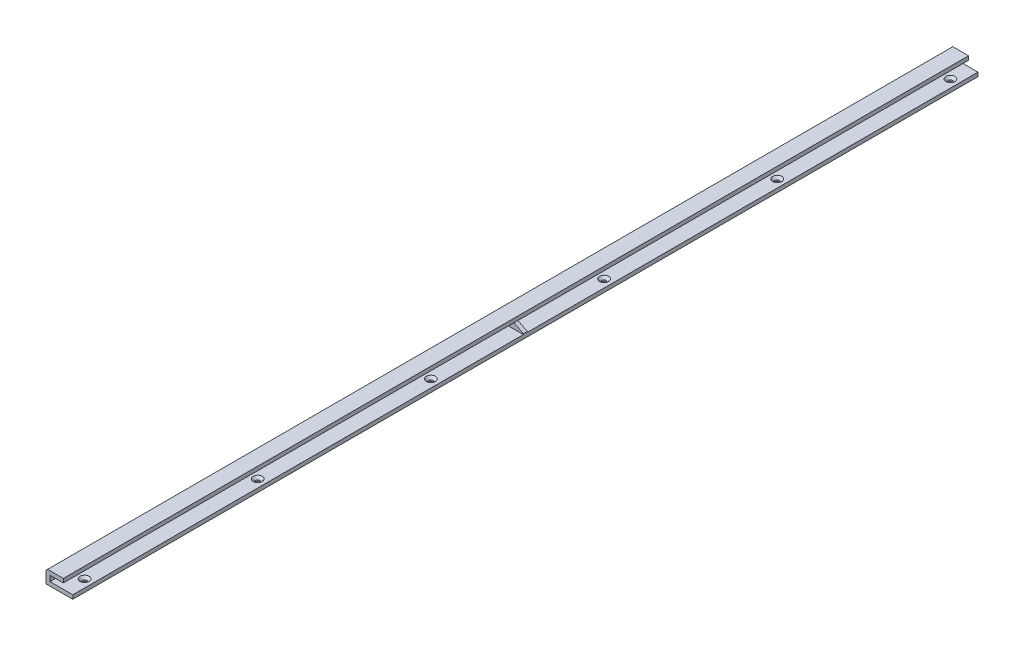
ISO-10303-21;
HEADER;
FILE_DESCRIPTION(('STEP AP214'),'2;1');
FILE_NAME('part.step','',(''),(''),'','','');
FILE_SCHEMA(('AUTOMOTIVE_DESIGN { 1 0 10303 214 1 1 1 1 }'));
ENDSEC;
DATA;
#1=APPLICATION_CONTEXT('core data for automotive mechanical design processes');
#2=APPLICATION_PROTOCOL_DEFINITION('international standard','automotive_design',2000,#1);
#3=PRODUCT_CONTEXT('',#1,'mechanical');
#4=PRODUCT('Part','Part','',(#3));
#5=PRODUCT_RELATED_PRODUCT_CATEGORY('part','',(#4));
#6=PRODUCT_DEFINITION_FORMATION('','',#4);
#7=PRODUCT_DEFINITION_CONTEXT('part definition',#1,'design');
#8=PRODUCT_DEFINITION('design','',#6,#7);
#9=PRODUCT_DEFINITION_SHAPE('','',#8);
#10=(LENGTH_UNIT() NAMED_UNIT(*) SI_UNIT(.MILLI.,.METRE.));
#11=(NAMED_UNIT(*) PLANE_ANGLE_UNIT() SI_UNIT($,.RADIAN.));
#12=(NAMED_UNIT(*) SI_UNIT($,.STERADIAN.) SOLID_ANGLE_UNIT());
#13=UNCERTAINTY_MEASURE_WITH_UNIT(LENGTH_MEASURE(1.E-05),#10,'distance_accuracy_value','');
#14=(GEOMETRIC_REPRESENTATION_CONTEXT(3) GLOBAL_UNCERTAINTY_ASSIGNED_CONTEXT((#13)) GLOBAL_UNIT_ASSIGNED_CONTEXT((#10,
#11,#12)) REPRESENTATION_CONTEXT('',''));
#15=CARTESIAN_POINT('',(0.,0.,0.));
#16=DIRECTION('',(0.,0.,1.));
#17=DIRECTION('',(1.,0.,0.));
#18=AXIS2_PLACEMENT_3D('',#15,#16,#17);
#19=CARTESIAN_POINT('',(0.,5.,-1150.));
#20=DIRECTION('',(0.,-1.,0.));
#21=DIRECTION('',(0.,0.,-1.));
#22=AXIS2_PLACEMENT_3D('',#19,#20,#21);
#23=PLANE('',#22);
#24=CARTESIAN_POINT('',(9.99999999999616,5.,-1125.));
#25=DIRECTION('',(0.,-1.,0.));
#26=DIRECTION('',(0.,0.,-1.));
#27=AXIS2_PLACEMENT_3D('',#24,#25,#26);
#28=CIRCLE('',#27,5.74999999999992);
#29=CARTESIAN_POINT('',(9.99999999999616,5.,-1130.75));
#30=VERTEX_POINT('',#29);
#31=EDGE_CURVE('E221',#30,#30,#28,.T.);
#32=ORIENTED_EDGE('',*,*,#31,.T.);
#33=EDGE_LOOP('',(#32));
#34=FACE_BOUND('',#33,.T.);
#35=CARTESIAN_POINT('',(9.99999999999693,5.,-905.));
#36=DIRECTION('',(0.,-1.,0.));
#37=DIRECTION('',(0.,0.,-1.));
#38=AXIS2_PLACEMENT_3D('',#35,#36,#37);
#39=CIRCLE('',#38,5.75000000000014);
#40=CARTESIAN_POINT('',(9.99999999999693,5.,-910.75));
#41=VERTEX_POINT('',#40);
#42=EDGE_CURVE('E218',#41,#41,#39,.T.);
#43=ORIENTED_EDGE('',*,*,#42,.T.);
#44=EDGE_LOOP('',(#43));
#45=FACE_BOUND('',#44,.T.);
#46=CARTESIAN_POINT('',(9.9999999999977,5.,-685.));
#47=DIRECTION('',(0.,-1.,0.));
#48=DIRECTION('',(0.,0.,-1.));
#49=AXIS2_PLACEMENT_3D('',#46,#47,#48);
#50=CIRCLE('',#49,5.75000000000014);
#51=CARTESIAN_POINT('',(9.9999999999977,5.,-690.75));
#52=VERTEX_POINT('',#51);
#53=EDGE_CURVE('E215',#52,#52,#50,.T.);
#54=ORIENTED_EDGE('',*,*,#53,.T.);
#55=EDGE_LOOP('',(#54));
#56=FACE_BOUND('',#55,.T.);
#57=DIRECTION('',(-1.,0.,0.));
#58=VECTOR('',#57,1.);
#59=CARTESIAN_POINT('',(20.,5.,-577.5));
#60=LINE('',#59,#58);
#61=CARTESIAN_POINT('',(20.,5.,-577.5));
#62=VERTEX_POINT('',#61);
#63=CARTESIAN_POINT('',(-9.,5.,-577.5));
#64=VERTEX_POINT('',#63);
#65=EDGE_CURVE('E138',#62,#64,#60,.T.);
#66=ORIENTED_EDGE('',*,*,#65,.F.);
#67=DIRECTION('',(0.,0.,-1.));
#68=VECTOR('',#67,1.);
#69=CARTESIAN_POINT('',(20.,5.,0.));
#70=LINE('',#69,#68);
#71=CARTESIAN_POINT('',(20.,5.,-1150.));
#72=VERTEX_POINT('',#71);
#73=EDGE_CURVE('E191',#62,#72,#70,.T.);
#74=ORIENTED_EDGE('',*,*,#73,.T.);
#75=DIRECTION('',(-1.,0.,0.));
#76=VECTOR('',#75,1.);
#77=CARTESIAN_POINT('',(0.,5.,-1150.));
#78=LINE('',#77,#76);
#79=CARTESIAN_POINT('',(-9.,5.,-1150.));
#80=VERTEX_POINT('',#79);
#81=EDGE_CURVE('E196',#72,#80,#78,.T.);
#82=ORIENTED_EDGE('',*,*,#81,.T.);
#83=DIRECTION('',(0.,0.,1.));
#84=VECTOR('',#83,1.);
#85=CARTESIAN_POINT('',(-9.,5.,-1150.));
#86=LINE('',#85,#84);
#87=EDGE_CURVE('E164',#80,#64,#86,.T.);
#88=ORIENTED_EDGE('',*,*,#87,.T.);
#89=EDGE_LOOP('',(#66,#74,#82,#88));
#90=FACE_BOUND('',#89,.T.);
#91=ADVANCED_FACE('F33',(#34,#45,#56,#90),#23,.F.);
#92=CARTESIAN_POINT('',(9.99999999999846,5.,-465.));
#93=DIRECTION('',(0.,-1.,0.));
#94=DIRECTION('',(0.,0.,-1.));
#95=AXIS2_PLACEMENT_3D('',#92,#93,#94);
#96=CIRCLE('',#95,5.74999999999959);
#97=CARTESIAN_POINT('',(9.99999999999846,5.,-470.75));
#98=VERTEX_POINT('',#97);
#99=EDGE_CURVE('E239',#98,#98,#96,.T.);
#100=ORIENTED_EDGE('',*,*,#99,.T.);
#101=EDGE_LOOP('',(#100));
#102=FACE_BOUND('',#101,.T.);
#103=CARTESIAN_POINT('',(9.99999999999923,5.,-245.));
#104=DIRECTION('',(0.,-1.,0.));
#105=DIRECTION('',(0.,0.,-1.));
#106=AXIS2_PLACEMENT_3D('',#103,#104,#105);
#107=CIRCLE('',#106,5.74999999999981);
#108=CARTESIAN_POINT('',(9.99999999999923,5.,-239.25));
#109=VERTEX_POINT('',#108);
#110=EDGE_CURVE('E236',#109,#109,#107,.T.);
#111=ORIENTED_EDGE('',*,*,#110,.T.);
#112=EDGE_LOOP('',(#111));
#113=FACE_BOUND('',#112,.T.);
#114=CARTESIAN_POINT('',(10.,5.,-25.));
#115=DIRECTION('',(0.,-1.,0.));
#116=DIRECTION('',(0.,0.,-1.));
#117=AXIS2_PLACEMENT_3D('',#114,#115,#116);
#118=CIRCLE('',#117,5.74999999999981);
#119=CARTESIAN_POINT('',(10.,5.,-30.7499999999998));
#120=VERTEX_POINT('',#119);
#121=EDGE_CURVE('E233',#120,#120,#118,.T.);
#122=ORIENTED_EDGE('',*,*,#121,.T.);
#123=EDGE_LOOP('',(#122));
#124=FACE_BOUND('',#123,.T.);
#125=DIRECTION('',(1.,0.,0.));
#126=VECTOR('',#125,1.);
#127=CARTESIAN_POINT('',(20.,5.,-572.5));
#128=LINE('',#127,#126);
#129=CARTESIAN_POINT('',(-9.,5.,-572.5));
#130=VERTEX_POINT('',#129);
#131=CARTESIAN_POINT('',(20.,5.,-572.5));
#132=VERTEX_POINT('',#131);
#133=EDGE_CURVE('E154',#130,#132,#128,.T.);
#134=ORIENTED_EDGE('',*,*,#133,.F.);
#135=CARTESIAN_POINT('',(-9.,5.,0.));
#136=VERTEX_POINT('',#135);
#137=EDGE_CURVE('E168',#130,#136,#86,.T.);
#138=ORIENTED_EDGE('',*,*,#137,.T.);
#139=DIRECTION('',(1.,0.,0.));
#140=VECTOR('',#139,1.);
#141=CARTESIAN_POINT('',(0.,5.,0.));
#142=LINE('',#141,#140);
#143=CARTESIAN_POINT('',(20.,5.,0.));
#144=VERTEX_POINT('',#143);
#145=EDGE_CURVE('E189',#136,#144,#142,.T.);
#146=ORIENTED_EDGE('',*,*,#145,.T.);
#147=EDGE_CURVE('E193',#144,#132,#70,.T.);
#148=ORIENTED_EDGE('',*,*,#147,.T.);
#149=EDGE_LOOP('',(#134,#138,#146,#148));
#150=FACE_BOUND('',#149,.T.);
#151=ADVANCED_FACE('F261',(#102,#113,#124,#150),#23,.F.);
#152=CARTESIAN_POINT('',(0.,12.,-1150.));
#153=DIRECTION('',(0.,-1.,0.));
#154=DIRECTION('',(0.,0.,-1.));
#155=AXIS2_PLACEMENT_3D('',#152,#153,#154);
#156=PLANE('',#155);
#157=DIRECTION('',(0.,0.,1.));
#158=VECTOR('',#157,1.);
#159=CARTESIAN_POINT('',(8.,12.,-1150.));
#160=LINE('',#159,#158);
#161=CARTESIAN_POINT('',(8.,12.,-1150.));
#162=VERTEX_POINT('',#161);
#163=CARTESIAN_POINT('',(8.,12.,-577.5));
#164=VERTEX_POINT('',#163);
#165=EDGE_CURVE('E152',#162,#164,#160,.T.);
#166=ORIENTED_EDGE('',*,*,#165,.T.);
#167=DIRECTION('',(-1.,0.,0.));
#168=VECTOR('',#167,1.);
#169=CARTESIAN_POINT('',(20.,12.,-577.5));
#170=LINE('',#169,#168);
#171=CARTESIAN_POINT('',(-9.,12.,-577.5));
#172=VERTEX_POINT('',#171);
#173=EDGE_CURVE('E135',#164,#172,#170,.T.);
#174=ORIENTED_EDGE('',*,*,#173,.T.);
#175=DIRECTION('',(0.,0.,1.));
#176=VECTOR('',#175,1.);
#177=CARTESIAN_POINT('',(-9.,12.,-1150.));
#178=LINE('',#177,#176);
#179=CARTESIAN_POINT('',(-9.,12.,-1150.));
#180=VERTEX_POINT('',#179);
#181=EDGE_CURVE('E149',#180,#172,#178,.T.);
#182=ORIENTED_EDGE('',*,*,#181,.F.);
#183=DIRECTION('',(1.,0.,0.));
#184=VECTOR('',#183,1.);
#185=CARTESIAN_POINT('',(0.,12.,-1150.));
#186=LINE('',#185,#184);
#187=EDGE_CURVE('E372',#180,#162,#186,.T.);
#188=ORIENTED_EDGE('',*,*,#187,.T.);
#189=EDGE_LOOP('',(#166,#174,#182,#188));
#190=FACE_BOUND('',#189,.T.);
#191=ADVANCED_FACE('F148',(#190),#156,.T.);
#192=CARTESIAN_POINT('',(-9.,12.,-572.5));
#193=VERTEX_POINT('',#192);
#194=CARTESIAN_POINT('',(-9.,12.,0.));
#195=VERTEX_POINT('',#194);
#196=EDGE_CURVE('E161',#193,#195,#178,.T.);
#197=ORIENTED_EDGE('',*,*,#196,.F.);
#198=DIRECTION('',(1.,0.,0.));
#199=VECTOR('',#198,1.);
#200=CARTESIAN_POINT('',(20.,12.,-572.5));
#201=LINE('',#200,#199);
#202=CARTESIAN_POINT('',(8.,12.,-572.5));
#203=VERTEX_POINT('',#202);
#204=EDGE_CURVE('E153',#193,#203,#201,.T.);
#205=ORIENTED_EDGE('',*,*,#204,.T.);
#206=CARTESIAN_POINT('',(8.,12.,0.));
#207=VERTEX_POINT('',#206);
#208=EDGE_CURVE('E160',#203,#207,#160,.T.);
#209=ORIENTED_EDGE('',*,*,#208,.T.);
#210=DIRECTION('',(1.,0.,0.));
#211=VECTOR('',#210,1.);
#212=CARTESIAN_POINT('',(0.,12.,0.));
#213=LINE('',#212,#211);
#214=EDGE_CURVE('E396',#195,#207,#213,.T.);
#215=ORIENTED_EDGE('',*,*,#214,.F.);
#216=EDGE_LOOP('',(#197,#205,#209,#215));
#217=FACE_BOUND('',#216,.T.);
#218=ADVANCED_FACE('F422',(#217),#156,.T.);
#219=CARTESIAN_POINT('',(-9.,5.,-1150.));
#220=DIRECTION('',(1.,0.,0.));
#221=DIRECTION('',(0.,0.,-1.));
#222=AXIS2_PLACEMENT_3D('',#219,#220,#221);
#223=PLANE('',#222);
#224=ORIENTED_EDGE('',*,*,#181,.T.);
#225=DIRECTION('',(0.,-1.,0.));
#226=VECTOR('',#225,1.);
#227=CARTESIAN_POINT('',(-9.,12.,-577.5));
#228=LINE('',#227,#226);
#229=EDGE_CURVE('E132',#172,#64,#228,.T.);
#230=ORIENTED_EDGE('',*,*,#229,.T.);
#231=ORIENTED_EDGE('',*,*,#87,.F.);
#232=DIRECTION('',(0.,1.,0.));
#233=VECTOR('',#232,1.);
#234=CARTESIAN_POINT('',(-9.,5.,-1150.));
#235=LINE('',#234,#233);
#236=EDGE_CURVE('E159',#80,#180,#235,.T.);
#237=ORIENTED_EDGE('',*,*,#236,.T.);
#238=EDGE_LOOP('',(#224,#230,#231,#237));
#239=FACE_BOUND('',#238,.T.);
#240=ADVANCED_FACE('F157',(#239),#223,.T.);
#241=ORIENTED_EDGE('',*,*,#137,.F.);
#242=DIRECTION('',(0.,-1.,0.));
#243=VECTOR('',#242,1.);
#244=CARTESIAN_POINT('',(-9.,12.,-572.5));
#245=LINE('',#244,#243);
#246=EDGE_CURVE('E144',#193,#130,#245,.T.);
#247=ORIENTED_EDGE('',*,*,#246,.F.);
#248=ORIENTED_EDGE('',*,*,#196,.T.);
#249=DIRECTION('',(0.,1.,0.));
#250=VECTOR('',#249,1.);
#251=CARTESIAN_POINT('',(-9.,5.,0.));
#252=LINE('',#251,#250);
#253=EDGE_CURVE('E398',#136,#195,#252,.T.);
#254=ORIENTED_EDGE('',*,*,#253,.F.);
#255=EDGE_LOOP('',(#241,#247,#248,#254));
#256=FACE_BOUND('',#255,.T.);
#257=ADVANCED_FACE('F277',(#256),#223,.T.);
#258=CARTESIAN_POINT('',(0.,0.,-1150.));
#259=DIRECTION('',(0.,-1.,0.));
#260=DIRECTION('',(0.,0.,-1.));
#261=AXIS2_PLACEMENT_3D('',#258,#259,#260);
#262=PLANE('',#261);
#263=CARTESIAN_POINT('',(9.99999999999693,0.,-905.));
#264=DIRECTION('',(0.,1.,0.));
#265=DIRECTION('',(0.,0.,1.));
#266=AXIS2_PLACEMENT_3D('',#263,#264,#265);
#267=CIRCLE('',#266,2.74999999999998);
#268=CARTESIAN_POINT('',(9.99999999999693,0.,-902.25));
#269=VERTEX_POINT('',#268);
#270=EDGE_CURVE('E172',#269,#269,#267,.T.);
#271=ORIENTED_EDGE('',*,*,#270,.T.);
#272=EDGE_LOOP('',(#271));
#273=FACE_BOUND('',#272,.T.);
#274=CARTESIAN_POINT('',(9.99999999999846,0.,-465.));
#275=DIRECTION('',(0.,1.,0.));
#276=DIRECTION('',(0.,0.,1.));
#277=AXIS2_PLACEMENT_3D('',#274,#275,#276);
#278=CIRCLE('',#277,2.75);
#279=CARTESIAN_POINT('',(9.99999999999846,0.,-462.25));
#280=VERTEX_POINT('',#279);
#281=EDGE_CURVE('E179',#280,#280,#278,.T.);
#282=ORIENTED_EDGE('',*,*,#281,.T.);
#283=EDGE_LOOP('',(#282));
#284=FACE_BOUND('',#283,.T.);
#285=CARTESIAN_POINT('',(10.,0.,-25.));
#286=DIRECTION('',(0.,1.,0.));
#287=DIRECTION('',(0.,0.,1.));
#288=AXIS2_PLACEMENT_3D('',#285,#286,#287);
#289=CIRCLE('',#288,2.75);
#290=CARTESIAN_POINT('',(10.,0.,-22.25));
#291=VERTEX_POINT('',#290);
#292=EDGE_CURVE('E185',#291,#291,#289,.T.);
#293=ORIENTED_EDGE('',*,*,#292,.T.);
#294=EDGE_LOOP('',(#293));
#295=FACE_BOUND('',#294,.T.);
#296=DIRECTION('',(1.,0.,0.));
#297=VECTOR('',#296,1.);
#298=CARTESIAN_POINT('',(0.,0.,0.));
#299=LINE('',#298,#297);
#300=CARTESIAN_POINT('',(-14.,0.,0.));
#301=VERTEX_POINT('',#300);
#302=CARTESIAN_POINT('',(20.,0.,0.));
#303=VERTEX_POINT('',#302);
#304=EDGE_CURVE('E188',#301,#303,#299,.T.);
#305=ORIENTED_EDGE('',*,*,#304,.F.);
#306=DIRECTION('',(0.,0.,1.));
#307=VECTOR('',#306,1.);
#308=CARTESIAN_POINT('',(-14.,0.,-1150.));
#309=LINE('',#308,#307);
#310=CARTESIAN_POINT('',(-14.,0.,-1150.));
#311=VERTEX_POINT('',#310);
#312=EDGE_CURVE('E173',#311,#301,#309,.T.);
#313=ORIENTED_EDGE('',*,*,#312,.F.);
#314=DIRECTION('',(-1.,0.,0.));
#315=VECTOR('',#314,1.);
#316=CARTESIAN_POINT('',(0.,0.,-1150.));
#317=LINE('',#316,#315);
#318=CARTESIAN_POINT('',(20.,0.,-1150.));
#319=VERTEX_POINT('',#318);
#320=EDGE_CURVE('E192',#319,#311,#317,.T.);
#321=ORIENTED_EDGE('',*,*,#320,.F.);
#322=DIRECTION('',(0.,0.,-1.));
#323=VECTOR('',#322,1.);
#324=CARTESIAN_POINT('',(20.,0.,0.));
#325=LINE('',#324,#323);
#326=EDGE_CURVE('E200',#303,#319,#325,.T.);
#327=ORIENTED_EDGE('',*,*,#326,.F.);
#328=EDGE_LOOP('',(#305,#313,#321,#327));
#329=FACE_BOUND('',#328,.T.);
#330=CARTESIAN_POINT('',(9.99999999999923,0.,-245.));
#331=DIRECTION('',(0.,1.,0.));
#332=DIRECTION('',(0.,0.,1.));
#333=AXIS2_PLACEMENT_3D('',#330,#331,#332);
#334=CIRCLE('',#333,2.75);
#335=CARTESIAN_POINT('',(9.99999999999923,0.,-242.25));
#336=VERTEX_POINT('',#335);
#337=EDGE_CURVE('E182',#336,#336,#334,.T.);
#338=ORIENTED_EDGE('',*,*,#337,.T.);
#339=EDGE_LOOP('',(#338));
#340=FACE_BOUND('',#339,.T.);
#341=CARTESIAN_POINT('',(9.9999999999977,0.,-685.));
#342=DIRECTION('',(0.,1.,0.));
#343=DIRECTION('',(0.,0.,1.));
#344=AXIS2_PLACEMENT_3D('',#341,#342,#343);
#345=CIRCLE('',#344,2.74999999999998);
#346=CARTESIAN_POINT('',(9.9999999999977,0.,-682.25));
#347=VERTEX_POINT('',#346);
#348=EDGE_CURVE('E176',#347,#347,#345,.T.);
#349=ORIENTED_EDGE('',*,*,#348,.T.);
#350=EDGE_LOOP('',(#349));
#351=FACE_BOUND('',#350,.T.);
#352=CARTESIAN_POINT('',(9.99999999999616,0.,-1125.));
#353=DIRECTION('',(0.,1.,0.));
#354=DIRECTION('',(0.,0.,1.));
#355=AXIS2_PLACEMENT_3D('',#352,#353,#354);
#356=CIRCLE('',#355,2.74999999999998);
#357=CARTESIAN_POINT('',(9.99999999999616,0.,-1122.25));
#358=VERTEX_POINT('',#357);
#359=EDGE_CURVE('E169',#358,#358,#356,.T.);
#360=ORIENTED_EDGE('',*,*,#359,.T.);
#361=EDGE_LOOP('',(#360));
#362=FACE_BOUND('',#361,.T.);
#363=ADVANCED_FACE('F273',(#273,#284,#295,#329,#340,#351,#362),#262,.T.);
#364=CARTESIAN_POINT('',(0.,5.,0.));
#365=DIRECTION('',(0.,0.,-1.));
#366=DIRECTION('',(-1.,0.,0.));
#367=AXIS2_PLACEMENT_3D('',#364,#365,#366);
#368=PLANE('',#367);
#369=ORIENTED_EDGE('',*,*,#304,.T.);
#370=DIRECTION('',(0.,-1.,0.));
#371=VECTOR('',#370,1.);
#372=CARTESIAN_POINT('',(20.,5.,0.));
#373=LINE('',#372,#371);
#374=EDGE_CURVE('E205',#144,#303,#373,.T.);
#375=ORIENTED_EDGE('',*,*,#374,.F.);
#376=ORIENTED_EDGE('',*,*,#145,.F.);
#377=ORIENTED_EDGE('',*,*,#253,.T.);
#378=ORIENTED_EDGE('',*,*,#214,.T.);
#379=DIRECTION('',(0.,1.,0.));
#380=VECTOR('',#379,1.);
#381=CARTESIAN_POINT('',(8.,17.,0.));
#382=LINE('',#381,#380);
#383=CARTESIAN_POINT('',(8.,17.,0.));
#384=VERTEX_POINT('',#383);
#385=EDGE_CURVE('E388',#207,#384,#382,.T.);
#386=ORIENTED_EDGE('',*,*,#385,.T.);
#387=DIRECTION('',(-1.,0.,0.));
#388=VECTOR('',#387,1.);
#389=CARTESIAN_POINT('',(0.,17.,0.));
#390=LINE('',#389,#388);
#391=CARTESIAN_POINT('',(-12.,17.,0.));
#392=VERTEX_POINT('',#391);
#393=EDGE_CURVE('E374',#384,#392,#390,.T.);
#394=ORIENTED_EDGE('',*,*,#393,.T.);
#395=DIRECTION('',(-0.707106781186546,-0.707106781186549,0.));
#396=VECTOR('',#395,1.);
#397=CARTESIAN_POINT('',(-14.,15.,0.));
#398=LINE('',#397,#396);
#399=CARTESIAN_POINT('',(-14.,15.,0.));
#400=VERTEX_POINT('',#399);
#401=EDGE_CURVE('E370',#392,#400,#398,.T.);
#402=ORIENTED_EDGE('',*,*,#401,.T.);
#403=DIRECTION('',(0.,-1.,0.));
#404=VECTOR('',#403,1.);
#405=CARTESIAN_POINT('',(-14.,0.,0.));
#406=LINE('',#405,#404);
#407=EDGE_CURVE('E362',#400,#301,#406,.T.);
#408=ORIENTED_EDGE('',*,*,#407,.T.);
#409=EDGE_LOOP('',(#369,#375,#376,#377,#378,#386,#394,#402,#408));
#410=FACE_BOUND('',#409,.T.);
#411=ADVANCED_FACE('F276',(#410),#368,.F.);
#412=CARTESIAN_POINT('',(20.,5.,0.));
#413=DIRECTION('',(-1.,0.,0.));
#414=DIRECTION('',(0.,0.,1.));
#415=AXIS2_PLACEMENT_3D('',#412,#413,#414);
#416=PLANE('',#415);
#417=DIRECTION('',(0.,-1.,0.));
#418=VECTOR('',#417,1.);
#419=CARTESIAN_POINT('',(20.,12.,-577.5));
#420=LINE('',#419,#418);
#421=CARTESIAN_POINT('',(20.,5.99999999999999,-577.5));
#422=VERTEX_POINT('',#421);
#423=EDGE_CURVE('E143',#422,#62,#420,.T.);
#424=ORIENTED_EDGE('',*,*,#423,.F.);
#425=DIRECTION('',(0.,0.,1.));
#426=VECTOR('',#425,1.);
#427=CARTESIAN_POINT('',(20.,5.99999999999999,0.));
#428=LINE('',#427,#426);
#429=CARTESIAN_POINT('',(20.,5.99999999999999,-572.5));
#430=VERTEX_POINT('',#429);
#431=EDGE_CURVE('E48',#422,#430,#428,.T.);
#432=ORIENTED_EDGE('',*,*,#431,.T.);
#433=DIRECTION('',(0.,-1.,0.));
#434=VECTOR('',#433,1.);
#435=CARTESIAN_POINT('',(20.,12.,-572.5));
#436=LINE('',#435,#434);
#437=EDGE_CURVE('E414',#430,#132,#436,.T.);
#438=ORIENTED_EDGE('',*,*,#437,.T.);
#439=ORIENTED_EDGE('',*,*,#147,.F.);
#440=ORIENTED_EDGE('',*,*,#374,.T.);
#441=ORIENTED_EDGE('',*,*,#326,.T.);
#442=DIRECTION('',(0.,-1.,0.));
#443=VECTOR('',#442,1.);
#444=CARTESIAN_POINT('',(20.,5.,-1150.));
#445=LINE('',#444,#443);
#446=EDGE_CURVE('E198',#72,#319,#445,.T.);
#447=ORIENTED_EDGE('',*,*,#446,.F.);
#448=ORIENTED_EDGE('',*,*,#73,.F.);
#449=EDGE_LOOP('',(#424,#432,#438,#439,#440,#441,#447,#448));
#450=FACE_BOUND('',#449,.T.);
#451=ADVANCED_FACE('F282',(#450),#416,.F.);
#452=CARTESIAN_POINT('',(0.,5.,-1150.));
#453=DIRECTION('',(0.,0.,1.));
#454=DIRECTION('',(1.,0.,0.));
#455=AXIS2_PLACEMENT_3D('',#452,#453,#454);
#456=PLANE('',#455);
#457=ORIENTED_EDGE('',*,*,#320,.T.);
#458=DIRECTION('',(0.,-1.,0.));
#459=VECTOR('',#458,1.);
#460=CARTESIAN_POINT('',(-14.,0.,-1150.));
#461=LINE('',#460,#459);
#462=CARTESIAN_POINT('',(-14.,15.,-1150.));
#463=VERTEX_POINT('',#462);
#464=EDGE_CURVE('E365',#463,#311,#461,.T.);
#465=ORIENTED_EDGE('',*,*,#464,.F.);
#466=DIRECTION('',(-0.707106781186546,-0.707106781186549,0.));
#467=VECTOR('',#466,1.);
#468=CARTESIAN_POINT('',(-14.,15.,-1150.));
#469=LINE('',#468,#467);
#470=CARTESIAN_POINT('',(-12.,17.,-1150.));
#471=VERTEX_POINT('',#470);
#472=EDGE_CURVE('E404',#471,#463,#469,.T.);
#473=ORIENTED_EDGE('',*,*,#472,.F.);
#474=DIRECTION('',(-1.,0.,0.));
#475=VECTOR('',#474,1.);
#476=CARTESIAN_POINT('',(0.,17.,-1150.));
#477=LINE('',#476,#475);
#478=CARTESIAN_POINT('',(8.,17.,-1150.));
#479=VERTEX_POINT('',#478);
#480=EDGE_CURVE('E407',#479,#471,#477,.T.);
#481=ORIENTED_EDGE('',*,*,#480,.F.);
#482=DIRECTION('',(0.,1.,0.));
#483=VECTOR('',#482,1.);
#484=CARTESIAN_POINT('',(8.,17.,-1150.));
#485=LINE('',#484,#483);
#486=EDGE_CURVE('E391',#162,#479,#485,.T.);
#487=ORIENTED_EDGE('',*,*,#486,.F.);
#488=ORIENTED_EDGE('',*,*,#187,.F.);
#489=ORIENTED_EDGE('',*,*,#236,.F.);
#490=ORIENTED_EDGE('',*,*,#81,.F.);
#491=ORIENTED_EDGE('',*,*,#446,.T.);
#492=EDGE_LOOP('',(#457,#465,#473,#481,#487,#488,#489,#490,#491));
#493=FACE_BOUND('',#492,.T.);
#494=ADVANCED_FACE('F279',(#493),#456,.F.);
#495=CARTESIAN_POINT('',(10.,5.,-25.));
#496=DIRECTION('',(0.,-1.,0.));
#497=DIRECTION('',(0.,0.,-1.));
#498=AXIS2_PLACEMENT_3D('',#495,#496,#497);
#499=CYLINDRICAL_SURFACE('',#498,2.75);
#500=CARTESIAN_POINT('',(10.,2.00000000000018,-25.));
#501=DIRECTION('',(0.,-1.,0.));
#502=DIRECTION('',(0.,0.,-1.));
#503=AXIS2_PLACEMENT_3D('',#500,#501,#502);
#504=CIRCLE('',#503,2.75);
#505=CARTESIAN_POINT('',(10.,2.00000000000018,-27.75));
#506=VERTEX_POINT('',#505);
#507=EDGE_CURVE('E11',#506,#506,#504,.F.);
#508=ORIENTED_EDGE('',*,*,#507,.T.);
#509=EDGE_LOOP('',(#508));
#510=FACE_BOUND('',#509,.T.);
#511=ORIENTED_EDGE('',*,*,#292,.F.);
#512=EDGE_LOOP('',(#511));
#513=FACE_BOUND('',#512,.T.);
#514=ADVANCED_FACE('F271',(#510,#513),#499,.F.);
#515=CARTESIAN_POINT('',(9.99999999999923,5.,-245.));
#516=DIRECTION('',(0.,-1.,0.));
#517=DIRECTION('',(0.,0.,-1.));
#518=AXIS2_PLACEMENT_3D('',#515,#516,#517);
#519=CYLINDRICAL_SURFACE('',#518,2.75);
#520=CARTESIAN_POINT('',(9.99999999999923,2.00000000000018,-245.));
#521=DIRECTION('',(0.,-1.,0.));
#522=DIRECTION('',(0.,0.,-1.));
#523=AXIS2_PLACEMENT_3D('',#520,#521,#522);
#524=CIRCLE('',#523,2.75);
#525=CARTESIAN_POINT('',(9.99999999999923,2.00000000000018,-242.25));
#526=VERTEX_POINT('',#525);
#527=EDGE_CURVE('E41',#526,#526,#524,.F.);
#528=ORIENTED_EDGE('',*,*,#527,.T.);
#529=EDGE_LOOP('',(#528));
#530=FACE_BOUND('',#529,.T.);
#531=ORIENTED_EDGE('',*,*,#337,.F.);
#532=EDGE_LOOP('',(#531));
#533=FACE_BOUND('',#532,.T.);
#534=ADVANCED_FACE('F244',(#530,#533),#519,.F.);
#535=CARTESIAN_POINT('',(9.99999999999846,5.,-465.));
#536=DIRECTION('',(0.,-1.,0.));
#537=DIRECTION('',(0.,0.,-1.));
#538=AXIS2_PLACEMENT_3D('',#535,#536,#537);
#539=CYLINDRICAL_SURFACE('',#538,2.75);
#540=CARTESIAN_POINT('',(9.99999999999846,2.00000000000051,-465.));
#541=DIRECTION('',(0.,-1.,0.));
#542=DIRECTION('',(0.,0.,-1.));
#543=AXIS2_PLACEMENT_3D('',#540,#541,#542);
#544=CIRCLE('',#543,2.75);
#545=CARTESIAN_POINT('',(9.99999999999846,2.00000000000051,-467.75));
#546=VERTEX_POINT('',#545);
#547=EDGE_CURVE('E230',#546,#546,#544,.F.);
#548=ORIENTED_EDGE('',*,*,#547,.T.);
#549=EDGE_LOOP('',(#548));
#550=FACE_BOUND('',#549,.T.);
#551=ORIENTED_EDGE('',*,*,#281,.F.);
#552=EDGE_LOOP('',(#551));
#553=FACE_BOUND('',#552,.T.);
#554=ADVANCED_FACE('F314',(#550,#553),#539,.F.);
#555=CARTESIAN_POINT('',(9.9999999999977,5.,-685.));
#556=DIRECTION('',(0.,-1.,0.));
#557=DIRECTION('',(0.,0.,-1.));
#558=AXIS2_PLACEMENT_3D('',#555,#556,#557);
#559=CYLINDRICAL_SURFACE('',#558,2.74999999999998);
#560=CARTESIAN_POINT('',(9.9999999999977,1.99999999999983,-685.));
#561=DIRECTION('',(0.,-1.,0.));
#562=DIRECTION('',(0.,0.,-1.));
#563=AXIS2_PLACEMENT_3D('',#560,#561,#562);
#564=CIRCLE('',#563,2.74999999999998);
#565=CARTESIAN_POINT('',(9.9999999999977,1.99999999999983,-687.75));
#566=VERTEX_POINT('',#565);
#567=EDGE_CURVE('E227',#566,#566,#564,.F.);
#568=ORIENTED_EDGE('',*,*,#567,.T.);
#569=EDGE_LOOP('',(#568));
#570=FACE_BOUND('',#569,.T.);
#571=ORIENTED_EDGE('',*,*,#348,.F.);
#572=EDGE_LOOP('',(#571));
#573=FACE_BOUND('',#572,.T.);
#574=ADVANCED_FACE('F310',(#570,#573),#559,.F.);
#575=CARTESIAN_POINT('',(9.99999999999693,5.,-905.));
#576=DIRECTION('',(0.,-1.,0.));
#577=DIRECTION('',(0.,0.,-1.));
#578=AXIS2_PLACEMENT_3D('',#575,#576,#577);
#579=CYLINDRICAL_SURFACE('',#578,2.74999999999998);
#580=CARTESIAN_POINT('',(9.99999999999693,1.99999999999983,-905.));
#581=DIRECTION('',(0.,-1.,0.));
#582=DIRECTION('',(0.,0.,-1.));
#583=AXIS2_PLACEMENT_3D('',#580,#581,#582);
#584=CIRCLE('',#583,2.74999999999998);
#585=CARTESIAN_POINT('',(9.99999999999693,1.99999999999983,-907.75));
#586=VERTEX_POINT('',#585);
#587=EDGE_CURVE('E224',#586,#586,#584,.F.);
#588=ORIENTED_EDGE('',*,*,#587,.T.);
#589=EDGE_LOOP('',(#588));
#590=FACE_BOUND('',#589,.T.);
#591=ORIENTED_EDGE('',*,*,#270,.F.);
#592=EDGE_LOOP('',(#591));
#593=FACE_BOUND('',#592,.T.);
#594=ADVANCED_FACE('F313',(#590,#593),#579,.F.);
#595=CARTESIAN_POINT('',(9.99999999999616,5.,-1125.));
#596=DIRECTION('',(0.,-1.,0.));
#597=DIRECTION('',(0.,0.,-1.));
#598=AXIS2_PLACEMENT_3D('',#595,#596,#597);
#599=CYLINDRICAL_SURFACE('',#598,2.74999999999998);
#600=CARTESIAN_POINT('',(9.99999999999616,1.99999999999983,-1125.));
#601=DIRECTION('',(0.,-1.,0.));
#602=DIRECTION('',(0.,0.,-1.));
#603=AXIS2_PLACEMENT_3D('',#600,#601,#602);
#604=CIRCLE('',#603,2.74999999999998);
#605=CARTESIAN_POINT('',(9.99999999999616,1.99999999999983,-1127.75));
#606=VERTEX_POINT('',#605);
#607=EDGE_CURVE('E212',#606,#606,#604,.F.);
#608=ORIENTED_EDGE('',*,*,#607,.T.);
#609=EDGE_LOOP('',(#608));
#610=FACE_BOUND('',#609,.T.);
#611=ORIENTED_EDGE('',*,*,#359,.F.);
#612=EDGE_LOOP('',(#611));
#613=FACE_BOUND('',#612,.T.);
#614=ADVANCED_FACE('F321',(#610,#613),#599,.F.);
#615=CARTESIAN_POINT('',(-14.,0.,-1150.));
#616=DIRECTION('',(-1.,0.,0.));
#617=DIRECTION('',(0.,0.,1.));
#618=AXIS2_PLACEMENT_3D('',#615,#616,#617);
#619=PLANE('',#618);
#620=ORIENTED_EDGE('',*,*,#407,.F.);
#621=DIRECTION('',(0.,0.,1.));
#622=VECTOR('',#621,1.);
#623=CARTESIAN_POINT('',(-14.,15.,-1150.));
#624=LINE('',#623,#622);
#625=EDGE_CURVE('E366',#463,#400,#624,.T.);
#626=ORIENTED_EDGE('',*,*,#625,.F.);
#627=ORIENTED_EDGE('',*,*,#464,.T.);
#628=ORIENTED_EDGE('',*,*,#312,.T.);
#629=EDGE_LOOP('',(#620,#626,#627,#628));
#630=FACE_BOUND('',#629,.T.);
#631=ADVANCED_FACE('F323',(#630),#619,.T.);
#632=CARTESIAN_POINT('',(-14.,15.,-1150.));
#633=DIRECTION('',(-0.707106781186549,0.707106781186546,0.));
#634=DIRECTION('',(-0.707106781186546,-0.707106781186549,0.));
#635=AXIS2_PLACEMENT_3D('',#632,#633,#634);
#636=PLANE('',#635);
#637=ORIENTED_EDGE('',*,*,#401,.F.);
#638=DIRECTION('',(0.,0.,1.));
#639=VECTOR('',#638,1.);
#640=CARTESIAN_POINT('',(-12.,17.,-1150.));
#641=LINE('',#640,#639);
#642=EDGE_CURVE('E379',#471,#392,#641,.T.);
#643=ORIENTED_EDGE('',*,*,#642,.F.);
#644=ORIENTED_EDGE('',*,*,#472,.T.);
#645=ORIENTED_EDGE('',*,*,#625,.T.);
#646=EDGE_LOOP('',(#637,#643,#644,#645));
#647=FACE_BOUND('',#646,.T.);
#648=ADVANCED_FACE('F330',(#647),#636,.T.);
#649=CARTESIAN_POINT('',(0.,17.,-1150.));
#650=DIRECTION('',(0.,1.,0.));
#651=DIRECTION('',(0.,0.,1.));
#652=AXIS2_PLACEMENT_3D('',#649,#650,#651);
#653=PLANE('',#652);
#654=ORIENTED_EDGE('',*,*,#393,.F.);
#655=DIRECTION('',(0.,0.,1.));
#656=VECTOR('',#655,1.);
#657=CARTESIAN_POINT('',(8.,17.,-1150.));
#658=LINE('',#657,#656);
#659=EDGE_CURVE('E380',#479,#384,#658,.T.);
#660=ORIENTED_EDGE('',*,*,#659,.F.);
#661=ORIENTED_EDGE('',*,*,#480,.T.);
#662=ORIENTED_EDGE('',*,*,#642,.T.);
#663=EDGE_LOOP('',(#654,#660,#661,#662));
#664=FACE_BOUND('',#663,.T.);
#665=ADVANCED_FACE('F447',(#664),#653,.T.);
#666=CARTESIAN_POINT('',(8.,17.,-1150.));
#667=DIRECTION('',(1.,0.,0.));
#668=DIRECTION('',(0.,0.,-1.));
#669=AXIS2_PLACEMENT_3D('',#666,#667,#668);
#670=PLANE('',#669);
#671=ORIENTED_EDGE('',*,*,#385,.F.);
#672=ORIENTED_EDGE('',*,*,#208,.F.);
#673=DIRECTION('',(0.,0.,-1.));
#674=VECTOR('',#673,1.);
#675=CARTESIAN_POINT('',(8.,12.,-1150.));
#676=LINE('',#675,#674);
#677=EDGE_CURVE('E402',#203,#164,#676,.T.);
#678=ORIENTED_EDGE('',*,*,#677,.T.);
#679=ORIENTED_EDGE('',*,*,#165,.F.);
#680=ORIENTED_EDGE('',*,*,#486,.T.);
#681=ORIENTED_EDGE('',*,*,#659,.T.);
#682=EDGE_LOOP('',(#671,#672,#678,#679,#680,#681));
#683=FACE_BOUND('',#682,.T.);
#684=ADVANCED_FACE('F386',(#683),#670,.T.);
#685=CARTESIAN_POINT('',(20.,12.,-577.5));
#686=DIRECTION('',(0.,0.,1.));
#687=DIRECTION('',(1.,0.,0.));
#688=AXIS2_PLACEMENT_3D('',#685,#686,#687);
#689=PLANE('',#688);
#690=ORIENTED_EDGE('',*,*,#173,.F.);
#691=DIRECTION('',(-0.894427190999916,0.447213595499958,0.));
#692=VECTOR('',#691,1.);
#693=CARTESIAN_POINT('',(7.99999999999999,12.,-577.5));
#694=LINE('',#693,#692);
#695=EDGE_CURVE('E56',#164,#422,#694,.F.);
#696=ORIENTED_EDGE('',*,*,#695,.T.);
#697=ORIENTED_EDGE('',*,*,#423,.T.);
#698=ORIENTED_EDGE('',*,*,#65,.T.);
#699=ORIENTED_EDGE('',*,*,#229,.F.);
#700=EDGE_LOOP('',(#690,#696,#697,#698,#699));
#701=FACE_BOUND('',#700,.T.);
#702=ADVANCED_FACE('F134',(#701),#689,.F.);
#703=CARTESIAN_POINT('',(20.,12.,-572.5));
#704=DIRECTION('',(0.,0.,-1.));
#705=DIRECTION('',(-1.,0.,0.));
#706=AXIS2_PLACEMENT_3D('',#703,#704,#705);
#707=PLANE('',#706);
#708=ORIENTED_EDGE('',*,*,#437,.F.);
#709=DIRECTION('',(0.894427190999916,-0.447213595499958,0.));
#710=VECTOR('',#709,1.);
#711=CARTESIAN_POINT('',(7.99999999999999,12.,-572.5));
#712=LINE('',#711,#710);
#713=EDGE_CURVE('E210',#430,#203,#712,.F.);
#714=ORIENTED_EDGE('',*,*,#713,.T.);
#715=ORIENTED_EDGE('',*,*,#204,.F.);
#716=ORIENTED_EDGE('',*,*,#246,.T.);
#717=ORIENTED_EDGE('',*,*,#133,.T.);
#718=EDGE_LOOP('',(#708,#714,#715,#716,#717));
#719=FACE_BOUND('',#718,.T.);
#720=ADVANCED_FACE('F293',(#719),#707,.F.);
#721=CARTESIAN_POINT('',(7.99999999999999,12.,-572.5));
#722=DIRECTION('',(-0.447213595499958,-0.894427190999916,0.));
#723=DIRECTION('',(0.894427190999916,-0.447213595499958,0.));
#724=AXIS2_PLACEMENT_3D('',#721,#722,#723);
#725=PLANE('',#724);
#726=ORIENTED_EDGE('',*,*,#713,.F.);
#727=ORIENTED_EDGE('',*,*,#431,.F.);
#728=ORIENTED_EDGE('',*,*,#695,.F.);
#729=ORIENTED_EDGE('',*,*,#677,.F.);
#730=EDGE_LOOP('',(#726,#727,#728,#729));
#731=FACE_BOUND('',#730,.T.);
#732=ADVANCED_FACE('F289',(#731),#725,.F.);
#733=CARTESIAN_POINT('',(9.99999999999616,1.99999999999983,-1125.));
#734=DIRECTION('',(0.,1.,0.));
#735=DIRECTION('',(0.,0.,1.));
#736=AXIS2_PLACEMENT_3D('',#733,#734,#735);
#737=CONICAL_SURFACE('',#736,2.74999999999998,0.78539816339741);
#738=ORIENTED_EDGE('',*,*,#31,.F.);
#739=EDGE_LOOP('',(#738));
#740=FACE_BOUND('',#739,.T.);
#741=ORIENTED_EDGE('',*,*,#607,.F.);
#742=EDGE_LOOP('',(#741));
#743=FACE_BOUND('',#742,.T.);
#744=ADVANCED_FACE('F292',(#740,#743),#737,.F.);
#745=CARTESIAN_POINT('',(9.99999999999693,1.99999999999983,-905.));
#746=DIRECTION('',(0.,1.,0.));
#747=DIRECTION('',(0.,0.,1.));
#748=AXIS2_PLACEMENT_3D('',#745,#746,#747);
#749=CONICAL_SURFACE('',#748,2.74999999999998,0.785398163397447);
#750=ORIENTED_EDGE('',*,*,#42,.F.);
#751=EDGE_LOOP('',(#750));
#752=FACE_BOUND('',#751,.T.);
#753=ORIENTED_EDGE('',*,*,#587,.F.);
#754=EDGE_LOOP('',(#753));
#755=FACE_BOUND('',#754,.T.);
#756=ADVANCED_FACE('F297',(#752,#755),#749,.F.);
#757=CARTESIAN_POINT('',(9.9999999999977,1.99999999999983,-685.));
#758=DIRECTION('',(0.,1.,0.));
#759=DIRECTION('',(0.,0.,1.));
#760=AXIS2_PLACEMENT_3D('',#757,#758,#759);
#761=CONICAL_SURFACE('',#760,2.74999999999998,0.785398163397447);
#762=ORIENTED_EDGE('',*,*,#53,.F.);
#763=EDGE_LOOP('',(#762));
#764=FACE_BOUND('',#763,.T.);
#765=ORIENTED_EDGE('',*,*,#567,.F.);
#766=EDGE_LOOP('',(#765));
#767=FACE_BOUND('',#766,.T.);
#768=ADVANCED_FACE('F256',(#764,#767),#761,.F.);
#769=CARTESIAN_POINT('',(9.99999999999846,2.00000000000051,-465.));
#770=DIRECTION('',(0.,1.,0.));
#771=DIRECTION('',(0.,0.,1.));
#772=AXIS2_PLACEMENT_3D('',#769,#770,#771);
#773=CONICAL_SURFACE('',#772,2.75,0.785398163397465);
#774=ORIENTED_EDGE('',*,*,#99,.F.);
#775=EDGE_LOOP('',(#774));
#776=FACE_BOUND('',#775,.T.);
#777=ORIENTED_EDGE('',*,*,#547,.F.);
#778=EDGE_LOOP('',(#777));
#779=FACE_BOUND('',#778,.T.);
#780=ADVANCED_FACE('F249',(#776,#779),#773,.F.);
#781=CARTESIAN_POINT('',(9.99999999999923,2.00000000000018,-245.));
#782=DIRECTION('',(0.,1.,0.));
#783=DIRECTION('',(0.,0.,1.));
#784=AXIS2_PLACEMENT_3D('',#781,#782,#783);
#785=CONICAL_SURFACE('',#784,2.75,0.785398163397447);
#786=CARTESIAN_POINT('',(9.99999999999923,5.,-239.25));
#787=CARTESIAN_POINT('',(9.99999999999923,4.96875000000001,-239.28125));
#788=CARTESIAN_POINT('',(9.99999999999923,4.93750000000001,-239.3125));
#789=CARTESIAN_POINT('',(9.99999999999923,4.87500000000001,-239.375));
#790=CARTESIAN_POINT('',(9.99999999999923,4.84375000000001,-239.40625));
#791=CARTESIAN_POINT('',(9.99999999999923,4.78125000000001,-239.46875));
#792=CARTESIAN_POINT('',(9.99999999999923,4.75000000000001,-239.5));
#793=CARTESIAN_POINT('',(9.99999999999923,4.68750000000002,-239.5625));
#794=CARTESIAN_POINT('',(9.99999999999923,4.65625000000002,-239.59375));
#795=CARTESIAN_POINT('',(9.99999999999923,4.59375000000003,-239.65625));
#796=CARTESIAN_POINT('',(9.99999999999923,4.56250000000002,-239.6875));
#797=CARTESIAN_POINT('',(9.99999999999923,4.50000000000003,-239.75));
#798=CARTESIAN_POINT('',(9.99999999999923,4.46875000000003,-239.78125));
#799=CARTESIAN_POINT('',(9.99999999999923,4.40625000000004,-239.84375));
#800=CARTESIAN_POINT('',(9.99999999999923,4.37500000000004,-239.875));
#801=CARTESIAN_POINT('',(9.99999999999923,4.31250000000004,-239.9375));
#802=CARTESIAN_POINT('',(9.99999999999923,4.28125000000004,-239.96875));
#803=CARTESIAN_POINT('',(9.99999999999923,4.21875000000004,-240.03125));
#804=CARTESIAN_POINT('',(9.99999999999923,4.18750000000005,-240.0625));
#805=CARTESIAN_POINT('',(9.99999999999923,4.12500000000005,-240.125));
#806=CARTESIAN_POINT('',(9.99999999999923,4.09375000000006,-240.15625));
#807=CARTESIAN_POINT('',(9.99999999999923,4.03125000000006,-240.21875));
#808=CARTESIAN_POINT('',(9.99999999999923,4.00000000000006,-240.25));
#809=CARTESIAN_POINT('',(9.99999999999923,3.93750000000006,-240.3125));
#810=CARTESIAN_POINT('',(9.99999999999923,3.90625000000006,-240.34375));
#811=CARTESIAN_POINT('',(9.99999999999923,3.84375000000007,-240.40625));
#812=CARTESIAN_POINT('',(9.99999999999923,3.81250000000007,-240.4375));
#813=CARTESIAN_POINT('',(9.99999999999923,3.75000000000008,-240.5));
#814=CARTESIAN_POINT('',(9.99999999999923,3.71875000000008,-240.53125));
#815=CARTESIAN_POINT('',(9.99999999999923,3.65625000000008,-240.59375));
#816=CARTESIAN_POINT('',(9.99999999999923,3.62500000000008,-240.625));
#817=CARTESIAN_POINT('',(9.99999999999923,3.56250000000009,-240.6875));
#818=CARTESIAN_POINT('',(9.99999999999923,3.53125000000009,-240.71875));
#819=CARTESIAN_POINT('',(9.99999999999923,3.46875000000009,-240.78125));
#820=CARTESIAN_POINT('',(9.99999999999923,3.43750000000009,-240.8125));
#821=CARTESIAN_POINT('',(9.99999999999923,3.37500000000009,-240.875));
#822=CARTESIAN_POINT('',(9.99999999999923,3.3437500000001,-240.90625));
#823=CARTESIAN_POINT('',(9.99999999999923,3.2812500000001,-240.96875));
#824=CARTESIAN_POINT('',(9.99999999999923,3.25000000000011,-241.));
#825=CARTESIAN_POINT('',(9.99999999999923,3.18750000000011,-241.0625));
#826=CARTESIAN_POINT('',(9.99999999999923,3.15625000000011,-241.09375));
#827=CARTESIAN_POINT('',(9.99999999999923,3.09375000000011,-241.15625));
#828=CARTESIAN_POINT('',(9.99999999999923,3.06250000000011,-241.1875));
#829=CARTESIAN_POINT('',(9.99999999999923,3.00000000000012,-241.25));
#830=CARTESIAN_POINT('',(9.99999999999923,2.96875000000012,-241.28125));
#831=CARTESIAN_POINT('',(9.99999999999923,2.90625000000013,-241.34375));
#832=CARTESIAN_POINT('',(9.99999999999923,2.87500000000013,-241.375));
#833=CARTESIAN_POINT('',(9.99999999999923,2.81250000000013,-241.4375));
#834=CARTESIAN_POINT('',(9.99999999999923,2.78125000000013,-241.46875));
#835=CARTESIAN_POINT('',(9.99999999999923,2.71875000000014,-241.53125));
#836=CARTESIAN_POINT('',(9.99999999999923,2.68750000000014,-241.5625));
#837=CARTESIAN_POINT('',(9.99999999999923,2.62500000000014,-241.625));
#838=CARTESIAN_POINT('',(9.99999999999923,2.59375000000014,-241.65625));
#839=CARTESIAN_POINT('',(9.99999999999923,2.53125000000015,-241.71875));
#840=CARTESIAN_POINT('',(9.99999999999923,2.50000000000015,-241.75));
#841=CARTESIAN_POINT('',(9.99999999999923,2.43750000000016,-241.8125));
#842=CARTESIAN_POINT('',(9.99999999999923,2.40625000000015,-241.84375));
#843=CARTESIAN_POINT('',(9.99999999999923,2.34375000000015,-241.90625));
#844=CARTESIAN_POINT('',(9.99999999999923,2.31250000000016,-241.9375));
#845=CARTESIAN_POINT('',(9.99999999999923,2.25000000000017,-242.));
#846=CARTESIAN_POINT('',(9.99999999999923,2.21875000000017,-242.03125));
#847=CARTESIAN_POINT('',(9.99999999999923,2.15625000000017,-242.09375));
#848=CARTESIAN_POINT('',(9.99999999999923,2.12500000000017,-242.125));
#849=CARTESIAN_POINT('',(9.99999999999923,2.06250000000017,-242.1875));
#850=CARTESIAN_POINT('',(9.99999999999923,2.03125000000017,-242.21875));
#851=CARTESIAN_POINT('',(9.99999999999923,2.00000000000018,-242.25));
#852=B_SPLINE_CURVE_WITH_KNOTS('',3,(#786,#787,#788,#789,#790,#791,#792,#793,#794,#795,#796,
#797,#798,#799,#800,#801,#802,#803,#804,#805,#806,#807,#808,#809,#810,#811,#812,#813,#814,#815,
#816,#817,#818,#819,#820,#821,#822,#823,#824,#825,#826,#827,#828,#829,#830,#831,#832,#833,#834,
#835,#836,#837,#838,#839,#840,#841,#842,#843,#844,#845,#846,#847,#848,#849,#850,#851),
.UNSPECIFIED.,.F.,.F.,(4,2,2,2,2,2,2,2,2,2,2,2,2,2,2,2,2,2,2,2,2,2,2,2,2,2,2,2,2,2,2,2,4),(0.,
0.132582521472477,0.265165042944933,0.397747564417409,0.530330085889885,0.662912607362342,
0.795495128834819,0.928077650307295,1.06066017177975,1.19324269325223,1.3258252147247,
1.45840773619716,1.59099025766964,1.72357277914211,1.85615530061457,1.98873782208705,
2.12132034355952,2.25390286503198,2.38648538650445,2.51906790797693,2.65165042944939,
2.78423295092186,2.91681547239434,3.0493979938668,3.18198051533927,3.31456303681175,
3.44714555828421,3.57972807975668,3.71231060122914,3.84489312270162,3.97747564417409,
4.11005816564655,4.24264068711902),.UNSPECIFIED.);
#853=EDGE_CURVE('BSEAM247',#109,#526,#852,.T.);
#854=ORIENTED_EDGE('',*,*,#110,.F.);
#855=ORIENTED_EDGE('',*,*,#527,.F.);
#856=ORIENTED_EDGE('',*,*,#853,.T.);
#857=ORIENTED_EDGE('',*,*,#853,.F.);
#858=EDGE_LOOP('',(#854,#856,#855,#857));
#859=FACE_BOUND('',#858,.T.);
#860=ADVANCED_FACE('F247',(#859),#785,.F.);
#861=CARTESIAN_POINT('',(10.,2.00000000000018,-25.));
#862=DIRECTION('',(0.,1.,0.));
#863=DIRECTION('',(0.,0.,1.));
#864=AXIS2_PLACEMENT_3D('',#861,#862,#863);
#865=CONICAL_SURFACE('',#864,2.75,0.785398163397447);
#866=ORIENTED_EDGE('',*,*,#121,.F.);
#867=EDGE_LOOP('',(#866));
#868=FACE_BOUND('',#867,.T.);
#869=ORIENTED_EDGE('',*,*,#507,.F.);
#870=EDGE_LOOP('',(#869));
#871=FACE_BOUND('',#870,.T.);
#872=ADVANCED_FACE('F35',(#868,#871),#865,.F.);
#873=CLOSED_SHELL('',(#91,#151,#191,#218,#240,#257,#363,#411,#451,#494,#514,#534,#554,#574,#594,
#614,#631,#648,#665,#684,#702,#720,#732,#744,#756,#768,#780,#860,#872));
#874=MANIFOLD_SOLID_BREP('B2',#873);
#875=ADVANCED_BREP_SHAPE_REPRESENTATION('',(#18,#874),#14);
#876=SHAPE_DEFINITION_REPRESENTATION(#9,#875);
ENDSEC;
END-ISO-10303-21;
